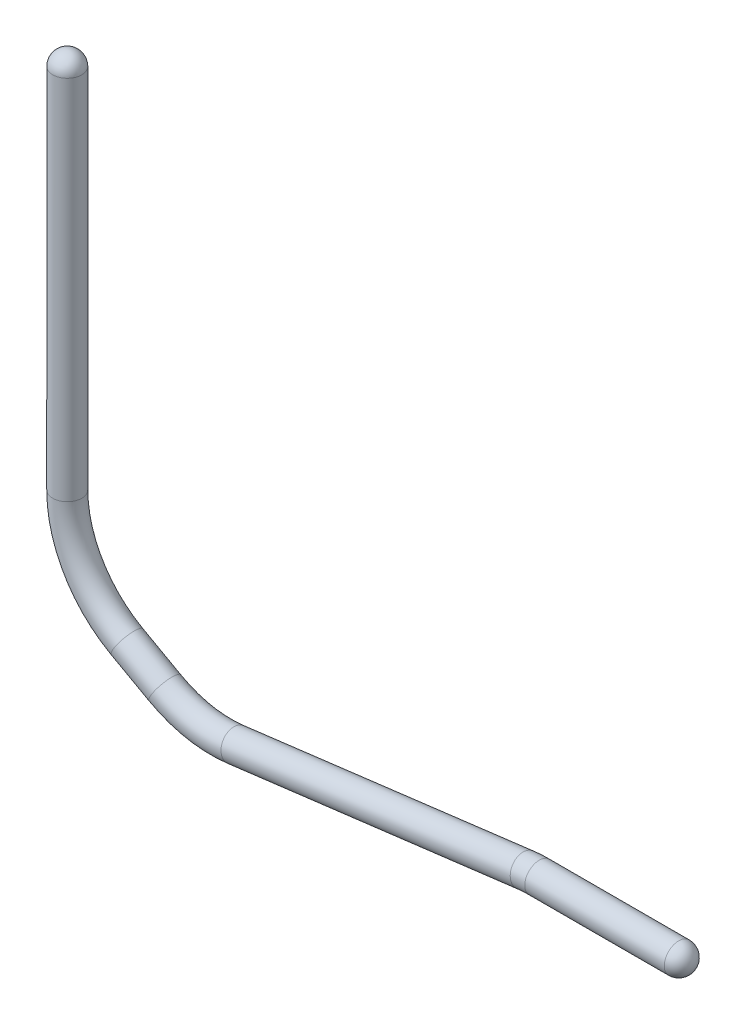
ISO-10303-21;
HEADER;
FILE_DESCRIPTION(('STEP AP214'),'2;1');
FILE_NAME('part.step','',(''),(''),'','','');
FILE_SCHEMA(('AUTOMOTIVE_DESIGN { 1 0 10303 214 1 1 1 1 }'));
ENDSEC;
DATA;
#1=APPLICATION_CONTEXT('core data for automotive mechanical design processes');
#2=APPLICATION_PROTOCOL_DEFINITION('international standard','automotive_design',2000,#1);
#3=PRODUCT_CONTEXT('',#1,'mechanical');
#4=PRODUCT('Part','Part','',(#3));
#5=PRODUCT_RELATED_PRODUCT_CATEGORY('part','',(#4));
#6=PRODUCT_DEFINITION_FORMATION('','',#4);
#7=PRODUCT_DEFINITION_CONTEXT('part definition',#1,'design');
#8=PRODUCT_DEFINITION('design','',#6,#7);
#9=PRODUCT_DEFINITION_SHAPE('','',#8);
#10=(LENGTH_UNIT() NAMED_UNIT(*) SI_UNIT(.MILLI.,.METRE.));
#11=(NAMED_UNIT(*) PLANE_ANGLE_UNIT() SI_UNIT($,.RADIAN.));
#12=(NAMED_UNIT(*) SI_UNIT($,.STERADIAN.) SOLID_ANGLE_UNIT());
#13=UNCERTAINTY_MEASURE_WITH_UNIT(LENGTH_MEASURE(1.E-05),#10,'distance_accuracy_value','');
#14=(GEOMETRIC_REPRESENTATION_CONTEXT(3) GLOBAL_UNCERTAINTY_ASSIGNED_CONTEXT((#13)) GLOBAL_UNIT_ASSIGNED_CONTEXT((#10,
#11,#12)) REPRESENTATION_CONTEXT('',''));
#15=CARTESIAN_POINT('',(0.,0.,0.));
#16=DIRECTION('',(0.,0.,1.));
#17=DIRECTION('',(1.,0.,0.));
#18=AXIS2_PLACEMENT_3D('',#15,#16,#17);
#19=CARTESIAN_POINT('',(0.,-63.1194330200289,0.));
#20=DIRECTION('',(0.,1.,0.));
#21=DIRECTION('',(0.,0.,-1.));
#22=AXIS2_PLACEMENT_3D('',#19,#20,#21);
#23=CYLINDRICAL_SURFACE('',#22,2.5);
#24=CARTESIAN_POINT('',(0.,0.,0.));
#25=DIRECTION('',(0.,-1.,0.));
#26=DIRECTION('',(1.,0.,0.));
#27=AXIS2_PLACEMENT_3D('',#24,#25,#26);
#28=CIRCLE('',#27,2.5);
#29=CARTESIAN_POINT('',(0.,0.,-2.5));
#30=VERTEX_POINT('',#29);
#31=CARTESIAN_POINT('',(0.,0.,2.5));
#32=VERTEX_POINT('',#31);
#33=EDGE_CURVE('E37',#30,#32,#28,.T.);
#34=ORIENTED_EDGE('',*,*,#33,.T.);
#35=CARTESIAN_POINT('',(0.,0.,0.));
#36=DIRECTION('',(0.,1.,0.));
#37=DIRECTION('',(-1.,0.,0.));
#38=AXIS2_PLACEMENT_3D('',#35,#36,#37);
#39=CIRCLE('',#38,2.5);
#40=EDGE_CURVE('E49',#30,#32,#39,.T.);
#41=ORIENTED_EDGE('',*,*,#40,.F.);
#42=EDGE_LOOP('',(#34,#41));
#43=FACE_BOUND('',#42,.T.);
#44=CARTESIAN_POINT('',(0.,-63.1194330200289,0.));
#45=DIRECTION('',(0.,1.,0.));
#46=DIRECTION('',(-1.,0.,0.));
#47=AXIS2_PLACEMENT_3D('',#44,#45,#46);
#48=CIRCLE('',#47,2.5);
#49=CARTESIAN_POINT('',(-2.5,-63.1194330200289,0.));
#50=VERTEX_POINT('',#49);
#51=EDGE_CURVE('E11',#50,#50,#48,.T.);
#52=ORIENTED_EDGE('',*,*,#51,.T.);
#53=EDGE_LOOP('',(#52));
#54=FACE_BOUND('',#53,.T.);
#55=ADVANCED_FACE('F16',(#43,#54),#23,.T.);
#56=CARTESIAN_POINT('',(20.,-63.1194330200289,0.));
#57=DIRECTION('',(0.,0.,-1.));
#58=DIRECTION('',(-1.,0.,0.));
#59=AXIS2_PLACEMENT_3D('',#56,#57,#58);
#60=TOROIDAL_SURFACE('',#59,20.,2.5);
#61=CARTESIAN_POINT('',(10.2871413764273,-80.6025785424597,0.));
#62=DIRECTION('',(-0.874157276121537,0.485642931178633,0.));
#63=DIRECTION('',(0.485642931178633,0.874157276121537,0.));
#64=AXIS2_PLACEMENT_3D('',#61,#62,#63);
#65=CIRCLE('',#64,2.5);
#66=CARTESIAN_POINT('',(9.07303404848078,-82.7879717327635,0.));
#67=VERTEX_POINT('',#66);
#68=EDGE_CURVE('E24',#67,#67,#65,.T.);
#69=CARTESIAN_POINT('',(20.,-63.1194330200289,0.));
#70=DIRECTION('',(0.,0.,-1.));
#71=DIRECTION('',(-1.,0.,0.));
#72=AXIS2_PLACEMENT_3D('',#69,#70,#71);
#73=CIRCLE('',#72,22.5);
#74=EDGE_CURVE('',#67,#50,#73,.T.);
#75=ORIENTED_EDGE('',*,*,#68,.T.);
#76=ORIENTED_EDGE('',*,*,#51,.F.);
#77=ORIENTED_EDGE('',*,*,#74,.T.);
#78=ORIENTED_EDGE('',*,*,#74,.F.);
#79=EDGE_LOOP('',(#75,#77,#76,#78));
#80=FACE_BOUND('',#79,.T.);
#81=ADVANCED_FACE('F88',(#80),#60,.T.);
#82=CARTESIAN_POINT('',(16.7890684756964,-84.2147602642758,0.));
#83=DIRECTION('',(-0.874157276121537,0.485642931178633,0.));
#84=DIRECTION('',(0.,0.,-1.));
#85=AXIS2_PLACEMENT_3D('',#82,#83,#84);
#86=CYLINDRICAL_SURFACE('',#85,2.5);
#87=ORIENTED_EDGE('',*,*,#68,.F.);
#88=EDGE_LOOP('',(#87));
#89=FACE_BOUND('',#88,.T.);
#90=CARTESIAN_POINT('',(16.7890684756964,-84.2147602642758,0.));
#91=DIRECTION('',(-0.874157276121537,0.485642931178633,0.));
#92=DIRECTION('',(0.485642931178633,0.874157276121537,0.));
#93=AXIS2_PLACEMENT_3D('',#90,#91,#92);
#94=CIRCLE('',#93,2.5);
#95=CARTESIAN_POINT('',(15.5749611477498,-86.4001534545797,0.));
#96=VERTEX_POINT('',#95);
#97=EDGE_CURVE('E75',#96,#96,#94,.T.);
#98=ORIENTED_EDGE('',*,*,#97,.T.);
#99=EDGE_LOOP('',(#98));
#100=FACE_BOUND('',#99,.T.);
#101=ADVANCED_FACE('F90',(#89,#100),#86,.T.);
#102=CARTESIAN_POINT('',(26.501927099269,-66.7316147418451,0.));
#103=DIRECTION('',(0.,0.,-1.));
#104=DIRECTION('',(-1.,0.,0.));
#105=AXIS2_PLACEMENT_3D('',#102,#103,#104);
#106=TOROIDAL_SURFACE('',#105,20.,2.5);
#107=CARTESIAN_POINT('',(28.9826217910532,-86.5771722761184,0.));
#108=DIRECTION('',(-0.992277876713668,-0.124034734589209,0.));
#109=DIRECTION('',(-0.124034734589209,0.992277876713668,0.));
#110=AXIS2_PLACEMENT_3D('',#107,#108,#109);
#111=CIRCLE('',#110,2.5);
#112=CARTESIAN_POINT('',(29.2927086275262,-89.0578669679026,0.));
#113=VERTEX_POINT('',#112);
#114=EDGE_CURVE('E71',#113,#113,#111,.T.);
#115=CARTESIAN_POINT('',(26.501927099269,-66.7316147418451,0.));
#116=DIRECTION('',(0.,0.,-1.));
#117=DIRECTION('',(-1.,0.,0.));
#118=AXIS2_PLACEMENT_3D('',#115,#116,#117);
#119=CIRCLE('',#118,22.5);
#120=EDGE_CURVE('',#113,#96,#119,.T.);
#121=ORIENTED_EDGE('',*,*,#114,.T.);
#122=ORIENTED_EDGE('',*,*,#97,.F.);
#123=ORIENTED_EDGE('',*,*,#120,.T.);
#124=ORIENTED_EDGE('',*,*,#120,.F.);
#125=EDGE_LOOP('',(#121,#123,#122,#124));
#126=FACE_BOUND('',#125,.T.);
#127=ADVANCED_FACE('F93',(#126),#106,.T.);
#128=CARTESIAN_POINT('',(78.7644602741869,-80.3544424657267,0.));
#129=DIRECTION('',(-0.992277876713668,-0.124034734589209,0.));
#130=DIRECTION('',(0.,0.,-1.));
#131=AXIS2_PLACEMENT_3D('',#128,#129,#130);
#132=CYLINDRICAL_SURFACE('',#131,2.5);
#133=ORIENTED_EDGE('',*,*,#114,.F.);
#134=EDGE_LOOP('',(#133));
#135=FACE_BOUND('',#134,.T.);
#136=CARTESIAN_POINT('',(78.7644602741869,-80.3544424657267,0.));
#137=DIRECTION('',(-0.992277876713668,-0.124034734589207,0.));
#138=DIRECTION('',(-0.124034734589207,0.992277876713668,0.));
#139=AXIS2_PLACEMENT_3D('',#136,#137,#138);
#140=CIRCLE('',#139,2.5);
#141=CARTESIAN_POINT('',(78.4543734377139,-77.8737477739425,0.));
#142=VERTEX_POINT('',#141);
#143=EDGE_CURVE('E67',#142,#142,#140,.T.);
#144=ORIENTED_EDGE('',*,*,#143,.T.);
#145=EDGE_LOOP('',(#144));
#146=FACE_BOUND('',#145,.T.);
#147=ADVANCED_FACE('F99',(#135,#146),#132,.T.);
#148=CARTESIAN_POINT('',(81.245154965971,-100.2,0.));
#149=DIRECTION('',(0.,0.,1.));
#150=DIRECTION('',(1.,0.,0.));
#151=AXIS2_PLACEMENT_3D('',#148,#149,#150);
#152=TOROIDAL_SURFACE('',#151,20.,2.5);
#153=CARTESIAN_POINT('',(81.245154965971,-80.2,0.));
#154=DIRECTION('',(-1.,0.,0.));
#155=DIRECTION('',(0.,1.,0.));
#156=AXIS2_PLACEMENT_3D('',#153,#154,#155);
#157=CIRCLE('',#156,2.5);
#158=CARTESIAN_POINT('',(81.245154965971,-77.7,0.));
#159=VERTEX_POINT('',#158);
#160=EDGE_CURVE('E64',#159,#159,#157,.T.);
#161=CARTESIAN_POINT('',(81.245154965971,-100.2,0.));
#162=DIRECTION('',(0.,0.,1.));
#163=DIRECTION('',(1.,0.,0.));
#164=AXIS2_PLACEMENT_3D('',#161,#162,#163);
#165=CIRCLE('',#164,22.5);
#166=EDGE_CURVE('',#159,#142,#165,.T.);
#167=ORIENTED_EDGE('',*,*,#160,.T.);
#168=ORIENTED_EDGE('',*,*,#143,.F.);
#169=ORIENTED_EDGE('',*,*,#166,.T.);
#170=ORIENTED_EDGE('',*,*,#166,.F.);
#171=EDGE_LOOP('',(#167,#169,#168,#170));
#172=FACE_BOUND('',#171,.T.);
#173=ADVANCED_FACE('F105',(#172),#152,.T.);
#174=CARTESIAN_POINT('',(105.2625,-80.2,0.));
#175=DIRECTION('',(-1.,0.,0.));
#176=DIRECTION('',(0.,0.,-1.));
#177=AXIS2_PLACEMENT_3D('',#174,#175,#176);
#178=CYLINDRICAL_SURFACE('',#177,2.49999999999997);
#179=ORIENTED_EDGE('',*,*,#160,.F.);
#180=EDGE_LOOP('',(#179));
#181=FACE_BOUND('',#180,.T.);
#182=CARTESIAN_POINT('',(105.2625,-80.2,0.));
#183=DIRECTION('',(-1.,0.,0.));
#184=DIRECTION('',(0.,-1.,0.));
#185=AXIS2_PLACEMENT_3D('',#182,#183,#184);
#186=CIRCLE('',#185,2.5);
#187=CARTESIAN_POINT('',(105.2625,-80.2,-2.49999999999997));
#188=VERTEX_POINT('',#187);
#189=CARTESIAN_POINT('',(105.2625,-80.2,2.5));
#190=VERTEX_POINT('',#189);
#191=EDGE_CURVE('E30',#188,#190,#186,.T.);
#192=ORIENTED_EDGE('',*,*,#191,.T.);
#193=CARTESIAN_POINT('',(105.2625,-80.2,0.));
#194=DIRECTION('',(1.,0.,0.));
#195=DIRECTION('',(0.,1.,0.));
#196=AXIS2_PLACEMENT_3D('',#193,#194,#195);
#197=CIRCLE('',#196,2.5);
#198=EDGE_CURVE('E42',#188,#190,#197,.T.);
#199=ORIENTED_EDGE('',*,*,#198,.F.);
#200=EDGE_LOOP('',(#192,#199));
#201=FACE_BOUND('',#200,.T.);
#202=ADVANCED_FACE('F47',(#181,#201),#178,.T.);
#203=CARTESIAN_POINT('',(0.,0.,0.));
#204=DIRECTION('',(0.,0.,1.));
#205=DIRECTION('',(-1.,0.,0.));
#206=AXIS2_PLACEMENT_3D('',#203,#204,#205);
#207=SPHERICAL_SURFACE('',#206,2.5);
#208=CARTESIAN_POINT('',(0.,0.,0.));
#209=DIRECTION('',(0.,-1.,0.));
#210=DIRECTION('',(1.,0.,0.));
#211=AXIS2_PLACEMENT_3D('',#208,#209,#210);
#212=SPHERICAL_SURFACE('',#211,2.5);
#213=ORIENTED_EDGE('',*,*,#33,.F.);
#214=ORIENTED_EDGE('',*,*,#40,.T.);
#215=EDGE_LOOP('',(#213,#214));
#216=FACE_BOUND('',#215,.T.);
#217=ADVANCED_FACE('F115',(#216),#212,.T.);
#218=CARTESIAN_POINT('',(105.2625,-80.2,0.));
#219=DIRECTION('',(0.,0.,1.));
#220=DIRECTION('',(0.,1.,0.));
#221=AXIS2_PLACEMENT_3D('',#218,#219,#220);
#222=SPHERICAL_SURFACE('',#221,2.5);
#223=CARTESIAN_POINT('',(105.2625,-80.2,0.));
#224=DIRECTION('',(-1.,0.,0.));
#225=DIRECTION('',(0.,-1.,0.));
#226=AXIS2_PLACEMENT_3D('',#223,#224,#225);
#227=SPHERICAL_SURFACE('',#226,2.5);
#228=ORIENTED_EDGE('',*,*,#191,.F.);
#229=ORIENTED_EDGE('',*,*,#198,.T.);
#230=EDGE_LOOP('',(#228,#229));
#231=FACE_BOUND('',#230,.T.);
#232=ADVANCED_FACE('F43',(#231),#227,.T.);
#233=CLOSED_SHELL('',(#55,#81,#101,#127,#147,#173,#202,#217,#232));
#234=MANIFOLD_SOLID_BREP('B1',#233);
#235=ADVANCED_BREP_SHAPE_REPRESENTATION('',(#18,#234),#14);
#236=SHAPE_DEFINITION_REPRESENTATION(#9,#235);
ENDSEC;
END-ISO-10303-21;
